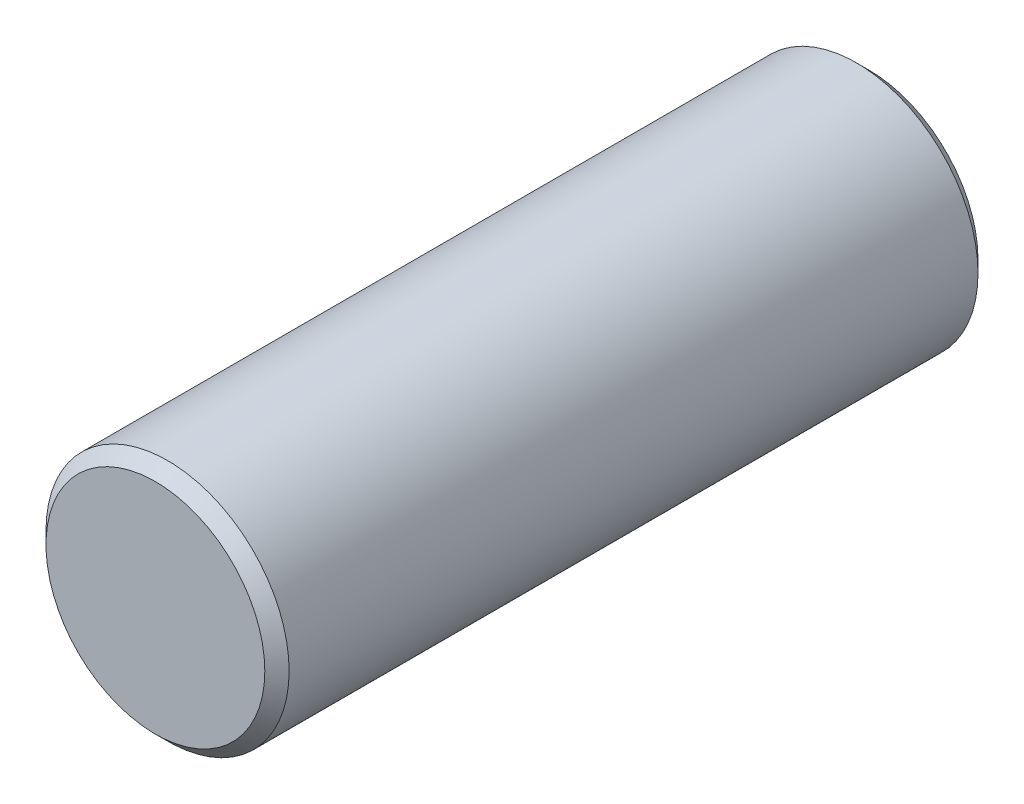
from build123d import *

# Parameters (mm, degrees)
ESQUISSE1_R          = 15
BASE_EXTRUSION_DEPTH = 88
CHANFREIN1_SIZE      = 1.5


with BuildPart() as part:
    # Esquisse1 → Base-Extrusion (new body)
    with BuildSketch(Plane.XY):
        Circle(ESQUISSE1_R)
    extrude(amount=BASE_EXTRUSION_DEPTH)

    # Chanfrein1
    chanfrein1_edges = [part.edges().sort_by_distance(p)[0] for p in [
        (-15, 0, 0),
        (-15, 0, 88),
    ]]
    chamfer(chanfrein1_edges, length=CHANFREIN1_SIZE)


solid = part.part
